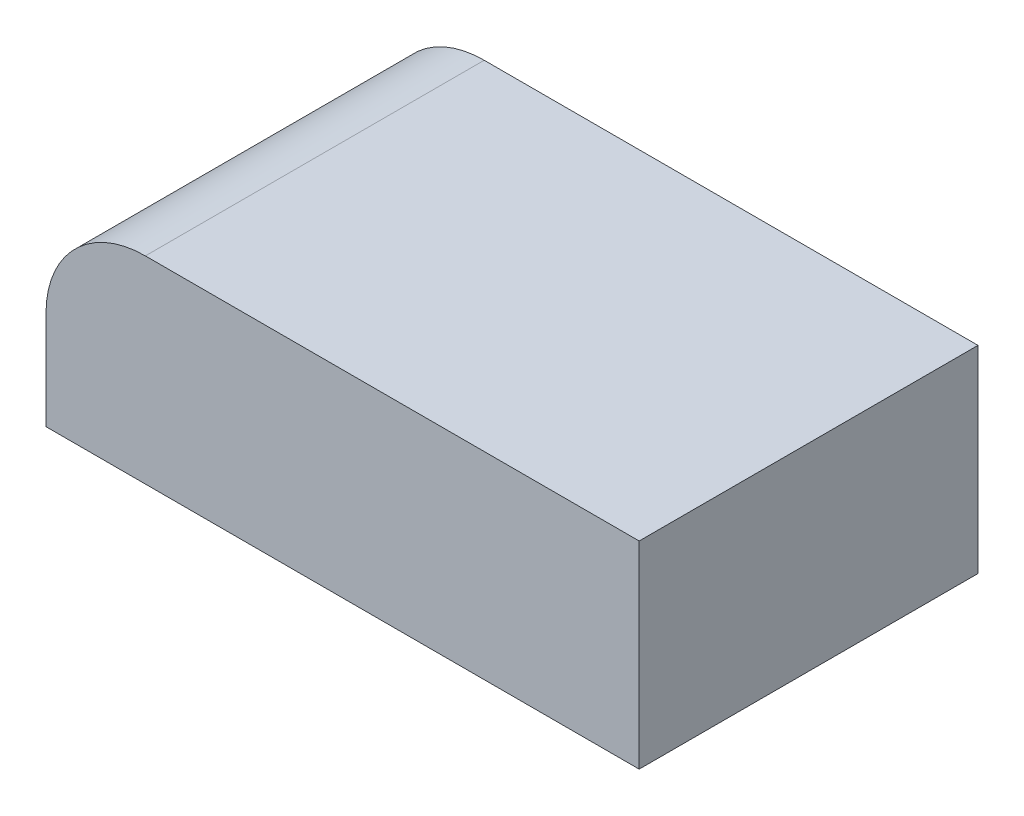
ISO-10303-21;
HEADER;
FILE_DESCRIPTION(('STEP AP214'),'2;1');
FILE_NAME('part.step','',(''),(''),'','','');
FILE_SCHEMA(('AUTOMOTIVE_DESIGN { 1 0 10303 214 1 1 1 1 }'));
ENDSEC;
DATA;
#1=APPLICATION_CONTEXT('core data for automotive mechanical design processes');
#2=APPLICATION_PROTOCOL_DEFINITION('international standard','automotive_design',2000,#1);
#3=PRODUCT_CONTEXT('',#1,'mechanical');
#4=PRODUCT('Part','Part','',(#3));
#5=PRODUCT_RELATED_PRODUCT_CATEGORY('part','',(#4));
#6=PRODUCT_DEFINITION_FORMATION('','',#4);
#7=PRODUCT_DEFINITION_CONTEXT('part definition',#1,'design');
#8=PRODUCT_DEFINITION('design','',#6,#7);
#9=PRODUCT_DEFINITION_SHAPE('','',#8);
#10=(LENGTH_UNIT() NAMED_UNIT(*) SI_UNIT(.MILLI.,.METRE.));
#11=(NAMED_UNIT(*) PLANE_ANGLE_UNIT() SI_UNIT($,.RADIAN.));
#12=(NAMED_UNIT(*) SI_UNIT($,.STERADIAN.) SOLID_ANGLE_UNIT());
#13=UNCERTAINTY_MEASURE_WITH_UNIT(LENGTH_MEASURE(1.E-05),#10,'distance_accuracy_value','');
#14=(GEOMETRIC_REPRESENTATION_CONTEXT(3) GLOBAL_UNCERTAINTY_ASSIGNED_CONTEXT((#13)) GLOBAL_UNIT_ASSIGNED_CONTEXT((#10,
#11,#12)) REPRESENTATION_CONTEXT('',''));
#15=CARTESIAN_POINT('',(0.,0.,0.));
#16=DIRECTION('',(0.,0.,1.));
#17=DIRECTION('',(1.,0.,0.));
#18=AXIS2_PLACEMENT_3D('',#15,#16,#17);
#19=CARTESIAN_POINT('',(96.2821502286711,0.,-55.));
#20=DIRECTION('',(0.,-1.,0.));
#21=DIRECTION('',(1.,0.,0.));
#22=AXIS2_PLACEMENT_3D('',#19,#20,#21);
#23=PLANE('',#22);
#24=DIRECTION('',(1.,0.,0.));
#25=VECTOR('',#24,1.);
#26=CARTESIAN_POINT('',(96.2821502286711,0.,0.));
#27=LINE('',#26,#25);
#28=CARTESIAN_POINT('',(0.,0.,0.));
#29=VERTEX_POINT('',#28);
#30=CARTESIAN_POINT('',(96.2821502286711,0.,0.));
#31=VERTEX_POINT('',#30);
#32=EDGE_CURVE('E110',#29,#31,#27,.T.);
#33=ORIENTED_EDGE('',*,*,#32,.F.);
#34=DIRECTION('',(0.,0.,1.));
#35=VECTOR('',#34,1.);
#36=CARTESIAN_POINT('',(0.,0.,-55.));
#37=LINE('',#36,#35);
#38=CARTESIAN_POINT('',(0.,0.,-55.));
#39=VERTEX_POINT('',#38);
#40=EDGE_CURVE('E11',#39,#29,#37,.T.);
#41=ORIENTED_EDGE('',*,*,#40,.F.);
#42=DIRECTION('',(1.,0.,0.));
#43=VECTOR('',#42,1.);
#44=CARTESIAN_POINT('',(96.2821502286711,0.,-55.));
#45=LINE('',#44,#43);
#46=CARTESIAN_POINT('',(96.2821502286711,0.,-55.));
#47=VERTEX_POINT('',#46);
#48=EDGE_CURVE('E105',#39,#47,#45,.T.);
#49=ORIENTED_EDGE('',*,*,#48,.T.);
#50=DIRECTION('',(0.,0.,1.));
#51=VECTOR('',#50,1.);
#52=CARTESIAN_POINT('',(96.2821502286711,0.,-55.));
#53=LINE('',#52,#51);
#54=EDGE_CURVE('E36',#47,#31,#53,.T.);
#55=ORIENTED_EDGE('',*,*,#54,.T.);
#56=EDGE_LOOP('',(#33,#41,#49,#55));
#57=FACE_BOUND('',#56,.T.);
#58=ADVANCED_FACE('F33',(#57),#23,.T.);
#59=CARTESIAN_POINT('',(0.,0.,-55.));
#60=DIRECTION('',(-1.,0.,0.));
#61=DIRECTION('',(0.,0.,1.));
#62=AXIS2_PLACEMENT_3D('',#59,#60,#61);
#63=PLANE('',#62);
#64=DIRECTION('',(0.,-1.,0.));
#65=VECTOR('',#64,1.);
#66=CARTESIAN_POINT('',(0.,0.,0.));
#67=LINE('',#66,#65);
#68=CARTESIAN_POINT('',(0.,15.9462777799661,0.));
#69=VERTEX_POINT('',#68);
#70=EDGE_CURVE('E119',#69,#29,#67,.T.);
#71=ORIENTED_EDGE('',*,*,#70,.F.);
#72=DIRECTION('',(0.,0.,1.));
#73=VECTOR('',#72,1.);
#74=CARTESIAN_POINT('',(0.,15.9462777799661,-55.));
#75=LINE('',#74,#73);
#76=CARTESIAN_POINT('',(0.,15.9462777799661,-55.));
#77=VERTEX_POINT('',#76);
#78=EDGE_CURVE('E42',#77,#69,#75,.T.);
#79=ORIENTED_EDGE('',*,*,#78,.F.);
#80=DIRECTION('',(0.,-1.,0.));
#81=VECTOR('',#80,1.);
#82=CARTESIAN_POINT('',(0.,0.,-55.));
#83=LINE('',#82,#81);
#84=EDGE_CURVE('E100',#77,#39,#83,.T.);
#85=ORIENTED_EDGE('',*,*,#84,.T.);
#86=ORIENTED_EDGE('',*,*,#40,.T.);
#87=EDGE_LOOP('',(#71,#79,#85,#86));
#88=FACE_BOUND('',#87,.T.);
#89=ADVANCED_FACE('F125',(#88),#63,.T.);
#90=CARTESIAN_POINT('',(16.1297189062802,15.9462777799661,-55.));
#91=DIRECTION('',(0.,0.,1.));
#92=DIRECTION('',(1.,0.,0.));
#93=AXIS2_PLACEMENT_3D('',#90,#91,#92);
#94=CYLINDRICAL_SURFACE('',#93,16.1297189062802);
#95=CARTESIAN_POINT('',(16.1297189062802,15.9462777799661,0.));
#96=DIRECTION('',(0.,0.,1.));
#97=DIRECTION('',(-1.,0.,0.));
#98=AXIS2_PLACEMENT_3D('',#95,#96,#97);
#99=CIRCLE('',#98,16.1297189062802);
#100=CARTESIAN_POINT('',(16.1297189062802,32.0759966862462,0.));
#101=VERTEX_POINT('',#100);
#102=EDGE_CURVE('E89',#101,#69,#99,.T.);
#103=ORIENTED_EDGE('',*,*,#102,.F.);
#104=DIRECTION('',(0.,0.,1.));
#105=VECTOR('',#104,1.);
#106=CARTESIAN_POINT('',(16.1297189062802,32.0759966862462,-55.));
#107=LINE('',#106,#105);
#108=CARTESIAN_POINT('',(16.1297189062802,32.0759966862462,-55.));
#109=VERTEX_POINT('',#108);
#110=EDGE_CURVE('E84',#109,#101,#107,.T.);
#111=ORIENTED_EDGE('',*,*,#110,.F.);
#112=CARTESIAN_POINT('',(16.1297189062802,15.9462777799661,-55.));
#113=DIRECTION('',(0.,0.,1.));
#114=DIRECTION('',(-1.,0.,0.));
#115=AXIS2_PLACEMENT_3D('',#112,#113,#114);
#116=CIRCLE('',#115,16.1297189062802);
#117=EDGE_CURVE('E87',#109,#77,#116,.T.);
#118=ORIENTED_EDGE('',*,*,#117,.T.);
#119=ORIENTED_EDGE('',*,*,#78,.T.);
#120=EDGE_LOOP('',(#103,#111,#118,#119));
#121=FACE_BOUND('',#120,.T.);
#122=ADVANCED_FACE('F86',(#121),#94,.T.);
#123=CARTESIAN_POINT('',(16.1297189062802,32.0759966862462,-55.));
#124=DIRECTION('',(0.,1.,0.));
#125=DIRECTION('',(0.,0.,1.));
#126=AXIS2_PLACEMENT_3D('',#123,#124,#125);
#127=PLANE('',#126);
#128=DIRECTION('',(-1.,0.,0.));
#129=VECTOR('',#128,1.);
#130=CARTESIAN_POINT('',(16.1297189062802,32.0759966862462,0.));
#131=LINE('',#130,#129);
#132=CARTESIAN_POINT('',(96.2821502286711,32.0759966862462,0.));
#133=VERTEX_POINT('',#132);
#134=EDGE_CURVE('E116',#133,#101,#131,.T.);
#135=ORIENTED_EDGE('',*,*,#134,.F.);
#136=DIRECTION('',(0.,0.,1.));
#137=VECTOR('',#136,1.);
#138=CARTESIAN_POINT('',(96.2821502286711,32.0759966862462,-55.));
#139=LINE('',#138,#137);
#140=CARTESIAN_POINT('',(96.2821502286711,32.0759966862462,-55.));
#141=VERTEX_POINT('',#140);
#142=EDGE_CURVE('E94',#141,#133,#139,.T.);
#143=ORIENTED_EDGE('',*,*,#142,.F.);
#144=DIRECTION('',(-1.,0.,0.));
#145=VECTOR('',#144,1.);
#146=CARTESIAN_POINT('',(16.1297189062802,32.0759966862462,-55.));
#147=LINE('',#146,#145);
#148=EDGE_CURVE('E99',#141,#109,#147,.T.);
#149=ORIENTED_EDGE('',*,*,#148,.T.);
#150=ORIENTED_EDGE('',*,*,#110,.T.);
#151=EDGE_LOOP('',(#135,#143,#149,#150));
#152=FACE_BOUND('',#151,.T.);
#153=ADVANCED_FACE('F102',(#152),#127,.T.);
#154=CARTESIAN_POINT('',(96.2821502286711,32.0759966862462,-55.));
#155=DIRECTION('',(1.,0.,0.));
#156=DIRECTION('',(0.,1.,0.));
#157=AXIS2_PLACEMENT_3D('',#154,#155,#156);
#158=PLANE('',#157);
#159=DIRECTION('',(0.,1.,0.));
#160=VECTOR('',#159,1.);
#161=CARTESIAN_POINT('',(96.2821502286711,32.0759966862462,0.));
#162=LINE('',#161,#160);
#163=EDGE_CURVE('E113',#31,#133,#162,.T.);
#164=ORIENTED_EDGE('',*,*,#163,.F.);
#165=ORIENTED_EDGE('',*,*,#54,.F.);
#166=DIRECTION('',(0.,1.,0.));
#167=VECTOR('',#166,1.);
#168=CARTESIAN_POINT('',(96.2821502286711,32.0759966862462,-55.));
#169=LINE('',#168,#167);
#170=EDGE_CURVE('E103',#47,#141,#169,.T.);
#171=ORIENTED_EDGE('',*,*,#170,.T.);
#172=ORIENTED_EDGE('',*,*,#142,.T.);
#173=EDGE_LOOP('',(#164,#165,#171,#172));
#174=FACE_BOUND('',#173,.T.);
#175=ADVANCED_FACE('F122',(#174),#158,.T.);
#176=CARTESIAN_POINT('',(16.1297189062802,15.9462777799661,-55.));
#177=DIRECTION('',(0.,0.,-1.));
#178=DIRECTION('',(-1.,0.,0.));
#179=AXIS2_PLACEMENT_3D('',#176,#177,#178);
#180=PLANE('',#179);
#181=ORIENTED_EDGE('',*,*,#48,.F.);
#182=ORIENTED_EDGE('',*,*,#84,.F.);
#183=ORIENTED_EDGE('',*,*,#117,.F.);
#184=ORIENTED_EDGE('',*,*,#148,.F.);
#185=ORIENTED_EDGE('',*,*,#170,.F.);
#186=EDGE_LOOP('',(#181,#182,#183,#184,#185));
#187=FACE_BOUND('',#186,.T.);
#188=ADVANCED_FACE('F98',(#187),#180,.T.);
#189=CARTESIAN_POINT('',(16.1297189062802,15.9462777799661,0.));
#190=DIRECTION('',(0.,0.,-1.));
#191=DIRECTION('',(-1.,0.,0.));
#192=AXIS2_PLACEMENT_3D('',#189,#190,#191);
#193=PLANE('',#192);
#194=ORIENTED_EDGE('',*,*,#32,.T.);
#195=ORIENTED_EDGE('',*,*,#163,.T.);
#196=ORIENTED_EDGE('',*,*,#134,.T.);
#197=ORIENTED_EDGE('',*,*,#102,.T.);
#198=ORIENTED_EDGE('',*,*,#70,.T.);
#199=EDGE_LOOP('',(#194,#195,#196,#197,#198));
#200=FACE_BOUND('',#199,.T.);
#201=ADVANCED_FACE('F124',(#200),#193,.F.);
#202=CLOSED_SHELL('',(#58,#89,#122,#153,#175,#188,#201));
#203=MANIFOLD_SOLID_BREP('B2',#202);
#204=ADVANCED_BREP_SHAPE_REPRESENTATION('',(#18,#203),#14);
#205=SHAPE_DEFINITION_REPRESENTATION(#9,#204);
ENDSEC;
END-ISO-10303-21;
